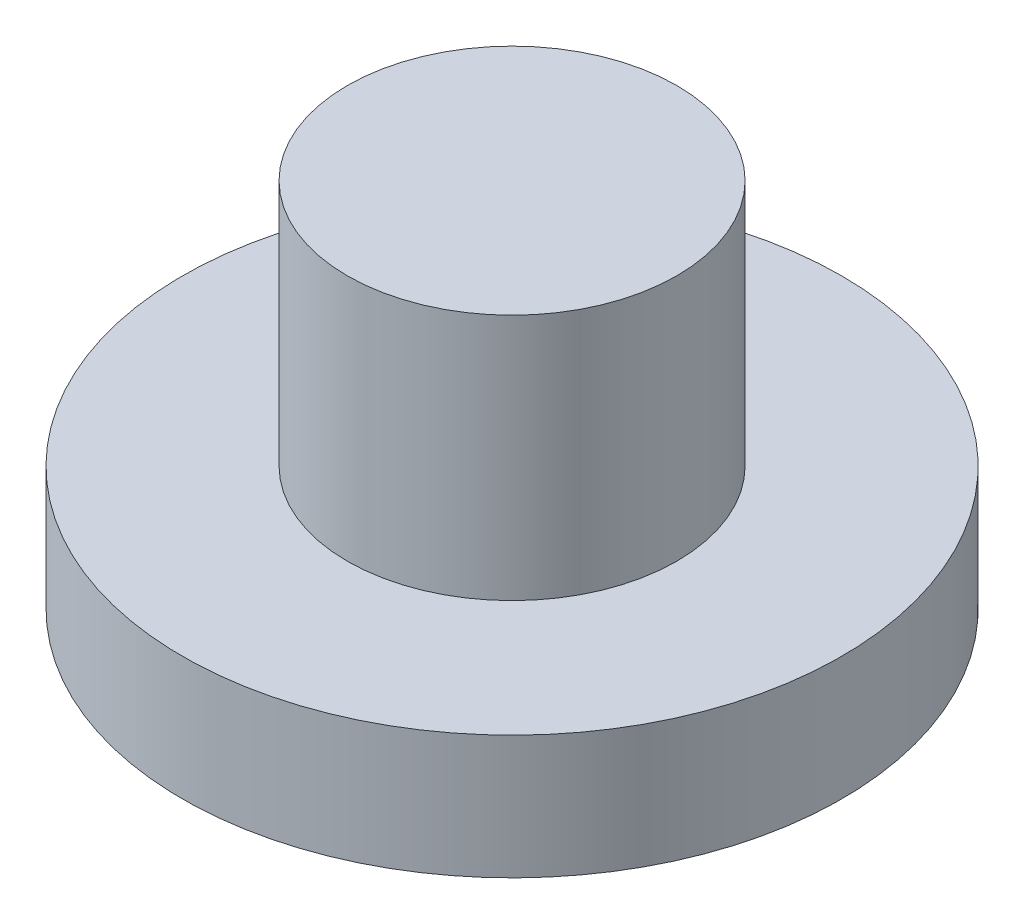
from build123d import *


with BuildPart() as part:
    # Sketch1 → Revolve1 (revolve)
    with BuildSketch(Plane.XY, mode=Mode.PRIVATE) as revolve1_sk:
        Polygon((0, 0), (-40, 0), (-40, 15), (-20, 15), (-20, 45), (0, 45), align=None)
    revolve(revolve1_sk.sketch.rotate(Axis((0, 0, 0), (0, 1, 0)), 270), axis=Axis((0, 0, 0), (0, 1, 0)))


solid = part.part
